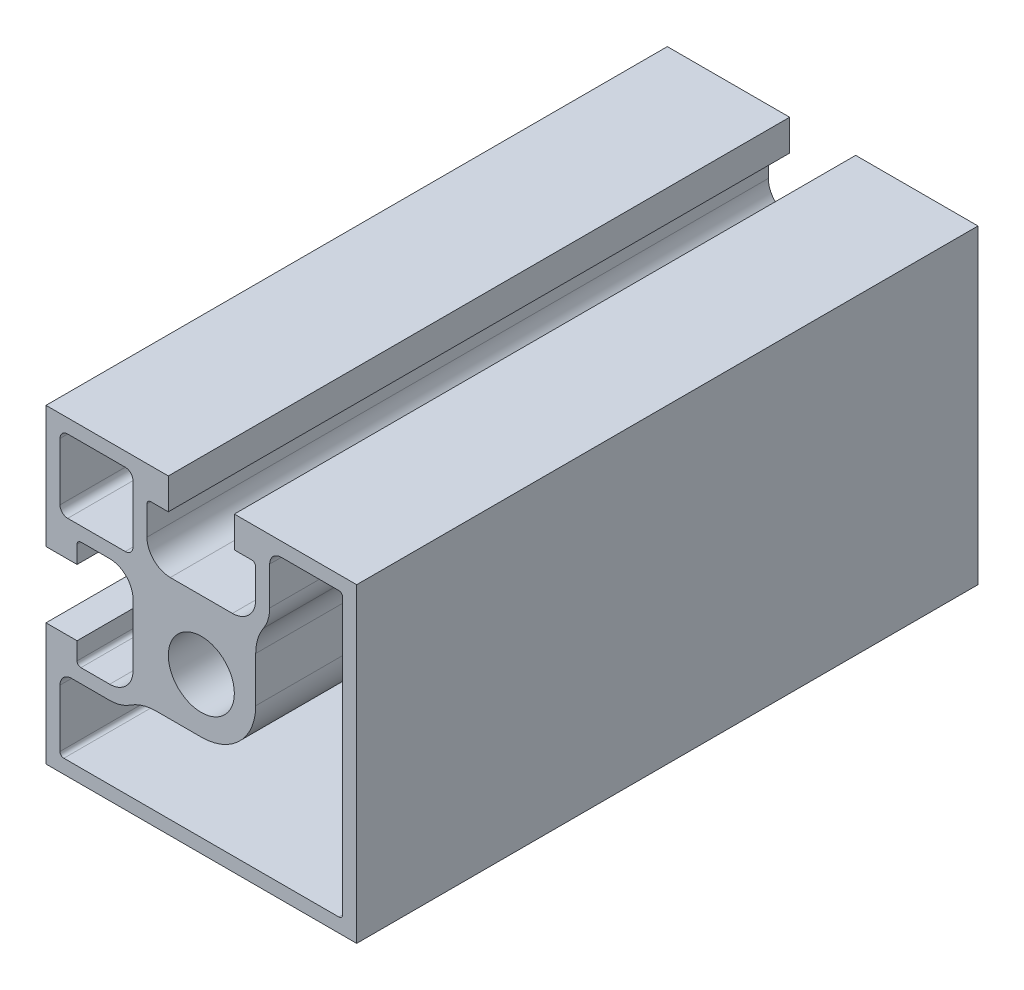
from build123d import *

# Parameters (mm, degrees)
SKETCH_1_R      = 4.25
EXTRUDE_1_DEPTH = 40


with BuildPart() as part:
    # Sketch 1 → Extrude 1 (new, symmetric)
    with BuildSketch(Plane.XY):
        with BuildLine():
            Line((-8.8, -4), (-8.8, 4))
            ThreePointArc((-8.8, 4), (-9.678679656, 6.121320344), (-11.8, 7))
            Line((-11.8, 7), (-15.5, 7))
            ThreePointArc((-15.5, 7), (-15.853553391, 6.853553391), (-16, 6.5))
            Line((-16, 6.5), (-16, 4.25))
            Line((-16, 4.25), (-20, 4.25))
            Line((-20, 4.25), (-20, 20))
            Line((-20, 20), (-4.25, 20))
            Line((-4.25, 20), (-4.25, 16))
            Line((-4.25, 16), (-6.5, 16))
            ThreePointArc((-6.5, 16), (-6.853553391, 15.853553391), (-7, 15.5))
            Line((-7, 15.5), (-7, 11.8))
            ThreePointArc((-7, 11.8), (-6.121320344, 9.678679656), (-4, 8.8))
            Line((-4, 8.8), (4, 8.8))
            ThreePointArc((4, 8.8), (6.121320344, 9.678679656), (7, 11.8))
            Line((7, 11.8), (7, 15.5))
            ThreePointArc((7, 15.5), (6.853553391, 15.853553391), (6.5, 16))
            Line((6.5, 16), (4.25, 16))
            Line((4.25, 16), (4.25, 20))
            Line((4.25, 20), (20, 20))
            Line((20, 20), (20, -20))
            Line((20, -20), (-20, -20))
            Line((-20, -20), (-20, -4.25))
            Line((-20, -4.25), (-16, -4.25))
            Line((-16, -4.25), (-16, -6.5))
            ThreePointArc((-16, -6.5), (-15.853553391, -6.853553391), (-15.5, -7))
            Line((-15.5, -7), (-11.8, -7))
            ThreePointArc((-11.8, -7), (-9.678679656, -6.121320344), (-8.8, -4))
        make_face()
        Circle(SKETCH_1_R, mode=Mode.SUBTRACT)
        with BuildLine():
            Line((-17.2, 18.2), (-9.8, 18.2))
            ThreePointArc((-9.8, 18.2), (-9.092893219, 17.907106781), (-8.8, 17.2))
            Line((-8.8, 17.2), (-8.8, 9.8))
            ThreePointArc((-8.8, 9.8), (-9.092893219, 9.092893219), (-9.8, 8.8))
            Line((-9.8, 8.8), (-17.2, 8.8))
            ThreePointArc((-17.2, 8.8), (-17.907106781, 9.092893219), (-18.2, 9.8))
            Line((-18.2, 9.8), (-18.2, 17.2))
            ThreePointArc((-18.2, 17.2), (-17.907106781, 17.907106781), (-17.2, 18.2))
        make_face(mode=Mode.SUBTRACT)
        with BuildLine():
            Line((10.3, 18.2), (17.7, 18.2))
            ThreePointArc((17.7, 18.2), (18.053553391, 18.053553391), (18.2, 17.7))
            Line((18.2, 17.7), (18.2, -17.7))
            ThreePointArc((18.2, -17.7), (18.053553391, -18.053553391), (17.7, -18.2))
            Line((17.7, -18.2), (-17.7, -18.2))
            ThreePointArc((-17.7, -18.2), (-18.053553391, -18.053553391), (-18.2, -17.7))
            Line((-18.2, -17.7), (-18.2, -10.3))
            ThreePointArc((-18.2, -10.3), (-17.760660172, -9.239339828), (-16.7, -8.8))
            Line((-16.7, -8.8), (-11.8, -8.8))
            ThreePointArc((-11.8, -8.8), (-10.414359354, -8.595650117), (-9.146700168, -8))
            ThreePointArc((-9.146700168, -8), (-7.562126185, -7.255437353), (-5.830075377, -7))
            Line((-5.830075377, -7), (0, -7))
            ThreePointArc((0, -7), (4.949747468, -4.949747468), (7, 0))
            Line((7, 0), (7, 5.830075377))
            ThreePointArc((7, 5.830075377), (7.255437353, 7.562126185), (8, 9.146700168))
            ThreePointArc((8, 9.146700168), (8.595650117, 10.414359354), (8.8, 11.8))
            Line((8.8, 11.8), (8.8, 16.7))
            ThreePointArc((8.8, 16.7), (9.239339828, 17.760660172), (10.3, 18.2))
        make_face(mode=Mode.SUBTRACT)
    extrude(amount=EXTRUDE_1_DEPTH, both=True)


solid = part.part
